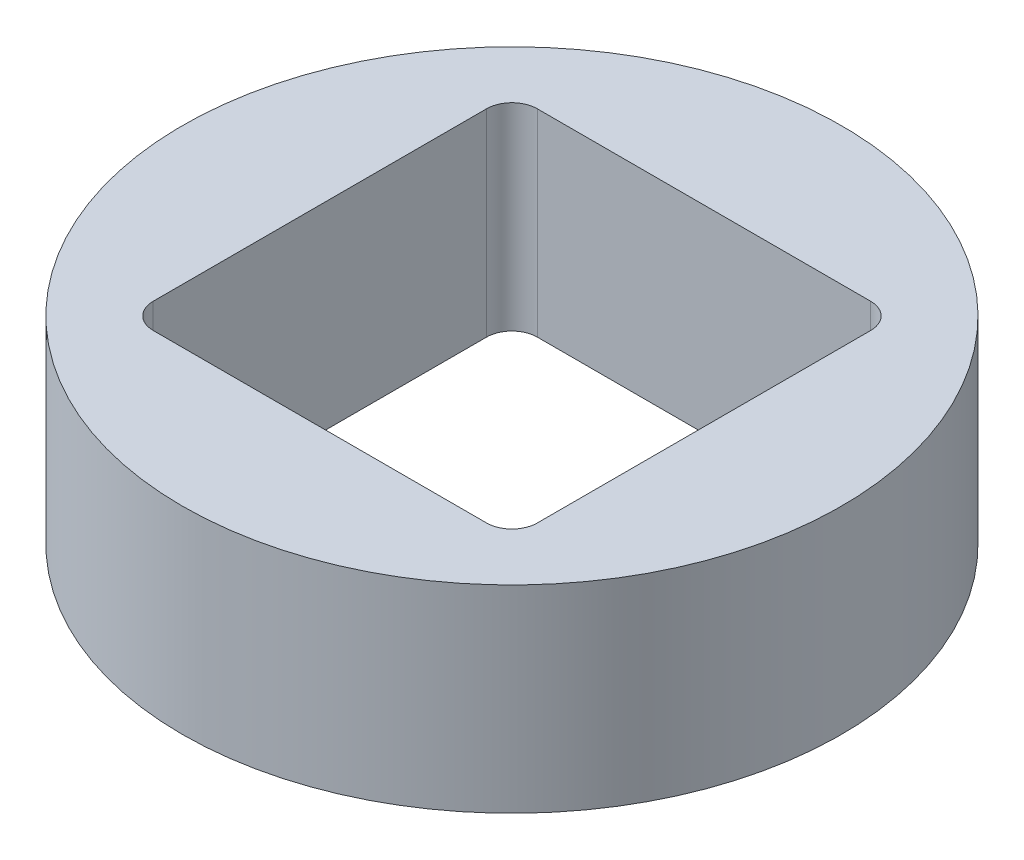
ISO-10303-21;
HEADER;
FILE_DESCRIPTION(('STEP AP214'),'2;1');
FILE_NAME('part.step','',(''),(''),'','','');
FILE_SCHEMA(('AUTOMOTIVE_DESIGN { 1 0 10303 214 1 1 1 1 }'));
ENDSEC;
DATA;
#1=APPLICATION_CONTEXT('core data for automotive mechanical design processes');
#2=APPLICATION_PROTOCOL_DEFINITION('international standard','automotive_design',2000,#1);
#3=PRODUCT_CONTEXT('',#1,'mechanical');
#4=PRODUCT('Part','Part','',(#3));
#5=PRODUCT_RELATED_PRODUCT_CATEGORY('part','',(#4));
#6=PRODUCT_DEFINITION_FORMATION('','',#4);
#7=PRODUCT_DEFINITION_CONTEXT('part definition',#1,'design');
#8=PRODUCT_DEFINITION('design','',#6,#7);
#9=PRODUCT_DEFINITION_SHAPE('','',#8);
#10=(LENGTH_UNIT() NAMED_UNIT(*) SI_UNIT(.MILLI.,.METRE.));
#11=(NAMED_UNIT(*) PLANE_ANGLE_UNIT() SI_UNIT($,.RADIAN.));
#12=(NAMED_UNIT(*) SI_UNIT($,.STERADIAN.) SOLID_ANGLE_UNIT());
#13=UNCERTAINTY_MEASURE_WITH_UNIT(LENGTH_MEASURE(1.E-05),#10,'distance_accuracy_value','');
#14=(GEOMETRIC_REPRESENTATION_CONTEXT(3) GLOBAL_UNCERTAINTY_ASSIGNED_CONTEXT((#13)) GLOBAL_UNIT_ASSIGNED_CONTEXT((#10,
#11,#12)) REPRESENTATION_CONTEXT('',''));
#15=CARTESIAN_POINT('',(0.,0.,0.));
#16=DIRECTION('',(0.,0.,1.));
#17=DIRECTION('',(1.,0.,0.));
#18=AXIS2_PLACEMENT_3D('',#15,#16,#17);
#19=CARTESIAN_POINT('',(0.,15.6,0.));
#20=DIRECTION('',(0.,1.,0.));
#21=DIRECTION('',(0.,0.,1.));
#22=AXIS2_PLACEMENT_3D('',#19,#20,#21);
#23=PLANE('',#22);
#24=CARTESIAN_POINT('',(0.,15.6,0.));
#25=DIRECTION('',(0.,1.,0.));
#26=DIRECTION('',(0.,0.,1.));
#27=AXIS2_PLACEMENT_3D('',#24,#25,#26);
#28=CIRCLE('',#27,26.);
#29=CARTESIAN_POINT('',(0.,15.6,26.));
#30=VERTEX_POINT('',#29);
#31=EDGE_CURVE('E11',#30,#30,#28,.T.);
#32=ORIENTED_EDGE('',*,*,#31,.T.);
#33=EDGE_LOOP('',(#32));
#34=FACE_BOUND('',#33,.T.);
#35=DIRECTION('',(0.,0.,-1.));
#36=VECTOR('',#35,1.);
#37=CARTESIAN_POINT('',(15.15,15.6,13.15));
#38=LINE('',#37,#36);
#39=CARTESIAN_POINT('',(15.15,15.6,13.15));
#40=VERTEX_POINT('',#39);
#41=CARTESIAN_POINT('',(15.15,15.6,-13.15));
#42=VERTEX_POINT('',#41);
#43=EDGE_CURVE('E113',#40,#42,#38,.T.);
#44=ORIENTED_EDGE('',*,*,#43,.F.);
#45=CARTESIAN_POINT('',(13.15,15.6,13.15));
#46=DIRECTION('',(0.,1.,0.));
#47=DIRECTION('',(0.,0.,1.));
#48=AXIS2_PLACEMENT_3D('',#45,#46,#47);
#49=CIRCLE('',#48,2.);
#50=CARTESIAN_POINT('',(13.15,15.6,15.15));
#51=VERTEX_POINT('',#50);
#52=EDGE_CURVE('E104',#51,#40,#49,.T.);
#53=ORIENTED_EDGE('',*,*,#52,.F.);
#54=DIRECTION('',(1.,0.,0.));
#55=VECTOR('',#54,1.);
#56=CARTESIAN_POINT('',(13.15,15.6,15.15));
#57=LINE('',#56,#55);
#58=CARTESIAN_POINT('',(-13.15,15.6,15.15));
#59=VERTEX_POINT('',#58);
#60=EDGE_CURVE('E146',#59,#51,#57,.T.);
#61=ORIENTED_EDGE('',*,*,#60,.F.);
#62=CARTESIAN_POINT('',(-13.15,15.6,13.15));
#63=DIRECTION('',(0.,1.,0.));
#64=DIRECTION('',(0.,0.,-1.));
#65=AXIS2_PLACEMENT_3D('',#62,#63,#64);
#66=CIRCLE('',#65,2.);
#67=CARTESIAN_POINT('',(-15.15,15.6,13.15));
#68=VERTEX_POINT('',#67);
#69=EDGE_CURVE('E143',#68,#59,#66,.T.);
#70=ORIENTED_EDGE('',*,*,#69,.F.);
#71=DIRECTION('',(0.,0.,1.));
#72=VECTOR('',#71,1.);
#73=CARTESIAN_POINT('',(-15.15,15.6,13.15));
#74=LINE('',#73,#72);
#75=CARTESIAN_POINT('',(-15.15,15.6,-13.15));
#76=VERTEX_POINT('',#75);
#77=EDGE_CURVE('E140',#76,#68,#74,.T.);
#78=ORIENTED_EDGE('',*,*,#77,.F.);
#79=CARTESIAN_POINT('',(-13.15,15.6,-13.15));
#80=DIRECTION('',(0.,1.,0.));
#81=DIRECTION('',(0.,0.,1.));
#82=AXIS2_PLACEMENT_3D('',#79,#80,#81);
#83=CIRCLE('',#82,2.);
#84=CARTESIAN_POINT('',(-13.15,15.6,-15.15));
#85=VERTEX_POINT('',#84);
#86=EDGE_CURVE('E137',#85,#76,#83,.T.);
#87=ORIENTED_EDGE('',*,*,#86,.F.);
#88=DIRECTION('',(-1.,0.,0.));
#89=VECTOR('',#88,1.);
#90=CARTESIAN_POINT('',(13.15,15.6,-15.15));
#91=LINE('',#90,#89);
#92=CARTESIAN_POINT('',(13.15,15.6,-15.15));
#93=VERTEX_POINT('',#92);
#94=EDGE_CURVE('E132',#93,#85,#91,.T.);
#95=ORIENTED_EDGE('',*,*,#94,.F.);
#96=CARTESIAN_POINT('',(13.15,15.6,-13.15));
#97=DIRECTION('',(0.,1.,0.));
#98=DIRECTION('',(0.,0.,1.));
#99=AXIS2_PLACEMENT_3D('',#96,#97,#98);
#100=CIRCLE('',#99,2.);
#101=EDGE_CURVE('E126',#42,#93,#100,.T.);
#102=ORIENTED_EDGE('',*,*,#101,.F.);
#103=EDGE_LOOP('',(#44,#53,#61,#70,#78,#87,#95,#102));
#104=FACE_BOUND('',#103,.T.);
#105=ADVANCED_FACE('F38',(#34,#104),#23,.T.);
#106=CARTESIAN_POINT('',(0.,0.,0.));
#107=DIRECTION('',(0.,1.,0.));
#108=DIRECTION('',(0.,0.,1.));
#109=AXIS2_PLACEMENT_3D('',#106,#107,#108);
#110=PLANE('',#109);
#111=CARTESIAN_POINT('',(0.,0.,0.));
#112=DIRECTION('',(0.,1.,0.));
#113=DIRECTION('',(0.,0.,1.));
#114=AXIS2_PLACEMENT_3D('',#111,#112,#113);
#115=CIRCLE('',#114,26.);
#116=CARTESIAN_POINT('',(0.,0.,26.));
#117=VERTEX_POINT('',#116);
#118=EDGE_CURVE('E42',#117,#117,#115,.T.);
#119=ORIENTED_EDGE('',*,*,#118,.F.);
#120=EDGE_LOOP('',(#119));
#121=FACE_BOUND('',#120,.T.);
#122=CARTESIAN_POINT('',(13.15,0.,13.15));
#123=DIRECTION('',(0.,1.,0.));
#124=DIRECTION('',(0.,0.,1.));
#125=AXIS2_PLACEMENT_3D('',#122,#123,#124);
#126=CIRCLE('',#125,2.);
#127=CARTESIAN_POINT('',(13.15,0.,15.15));
#128=VERTEX_POINT('',#127);
#129=CARTESIAN_POINT('',(15.15,0.,13.15));
#130=VERTEX_POINT('',#129);
#131=EDGE_CURVE('E62',#128,#130,#126,.T.);
#132=ORIENTED_EDGE('',*,*,#131,.T.);
#133=DIRECTION('',(0.,0.,-1.));
#134=VECTOR('',#133,1.);
#135=CARTESIAN_POINT('',(15.15,0.,13.15));
#136=LINE('',#135,#134);
#137=CARTESIAN_POINT('',(15.15,0.,-13.15));
#138=VERTEX_POINT('',#137);
#139=EDGE_CURVE('E120',#130,#138,#136,.T.);
#140=ORIENTED_EDGE('',*,*,#139,.T.);
#141=CARTESIAN_POINT('',(13.15,0.,-13.15));
#142=DIRECTION('',(0.,1.,0.));
#143=DIRECTION('',(0.,0.,1.));
#144=AXIS2_PLACEMENT_3D('',#141,#142,#143);
#145=CIRCLE('',#144,2.);
#146=CARTESIAN_POINT('',(13.15,0.,-15.15));
#147=VERTEX_POINT('',#146);
#148=EDGE_CURVE('E153',#138,#147,#145,.T.);
#149=ORIENTED_EDGE('',*,*,#148,.T.);
#150=DIRECTION('',(-1.,0.,0.));
#151=VECTOR('',#150,1.);
#152=CARTESIAN_POINT('',(13.15,0.,-15.15));
#153=LINE('',#152,#151);
#154=CARTESIAN_POINT('',(-13.15,0.,-15.15));
#155=VERTEX_POINT('',#154);
#156=EDGE_CURVE('E157',#147,#155,#153,.T.);
#157=ORIENTED_EDGE('',*,*,#156,.T.);
#158=CARTESIAN_POINT('',(-13.15,0.,-13.15));
#159=DIRECTION('',(0.,1.,0.));
#160=DIRECTION('',(0.,0.,1.));
#161=AXIS2_PLACEMENT_3D('',#158,#159,#160);
#162=CIRCLE('',#161,2.);
#163=CARTESIAN_POINT('',(-15.15,0.,-13.15));
#164=VERTEX_POINT('',#163);
#165=EDGE_CURVE('E161',#155,#164,#162,.T.);
#166=ORIENTED_EDGE('',*,*,#165,.T.);
#167=DIRECTION('',(0.,0.,1.));
#168=VECTOR('',#167,1.);
#169=CARTESIAN_POINT('',(-15.15,0.,13.15));
#170=LINE('',#169,#168);
#171=CARTESIAN_POINT('',(-15.15,0.,13.15));
#172=VERTEX_POINT('',#171);
#173=EDGE_CURVE('E164',#164,#172,#170,.T.);
#174=ORIENTED_EDGE('',*,*,#173,.T.);
#175=CARTESIAN_POINT('',(-13.15,0.,13.15));
#176=DIRECTION('',(0.,1.,0.));
#177=DIRECTION('',(0.,0.,-1.));
#178=AXIS2_PLACEMENT_3D('',#175,#176,#177);
#179=CIRCLE('',#178,2.);
#180=CARTESIAN_POINT('',(-13.15,0.,15.15));
#181=VERTEX_POINT('',#180);
#182=EDGE_CURVE('E168',#172,#181,#179,.T.);
#183=ORIENTED_EDGE('',*,*,#182,.T.);
#184=DIRECTION('',(1.,0.,0.));
#185=VECTOR('',#184,1.);
#186=CARTESIAN_POINT('',(13.15,0.,15.15));
#187=LINE('',#186,#185);
#188=EDGE_CURVE('E114',#181,#128,#187,.T.);
#189=ORIENTED_EDGE('',*,*,#188,.T.);
#190=EDGE_LOOP('',(#132,#140,#149,#157,#166,#174,#183,#189));
#191=FACE_BOUND('',#190,.T.);
#192=ADVANCED_FACE('F197',(#121,#191),#110,.F.);
#193=CARTESIAN_POINT('',(0.,15.6,0.));
#194=DIRECTION('',(0.,-1.,0.));
#195=DIRECTION('',(0.,0.,-1.));
#196=AXIS2_PLACEMENT_3D('',#193,#194,#195);
#197=CYLINDRICAL_SURFACE('',#196,26.);
#198=ORIENTED_EDGE('',*,*,#31,.F.);
#199=EDGE_LOOP('',(#198));
#200=FACE_BOUND('',#199,.T.);
#201=ORIENTED_EDGE('',*,*,#118,.T.);
#202=EDGE_LOOP('',(#201));
#203=FACE_BOUND('',#202,.T.);
#204=ADVANCED_FACE('F40',(#200,#203),#197,.T.);
#205=CARTESIAN_POINT('',(13.15,15.6,13.15));
#206=DIRECTION('',(0.,-1.,0.));
#207=DIRECTION('',(0.,0.,-1.));
#208=AXIS2_PLACEMENT_3D('',#205,#206,#207);
#209=CYLINDRICAL_SURFACE('',#208,2.);
#210=ORIENTED_EDGE('',*,*,#131,.F.);
#211=DIRECTION('',(0.,-1.,0.));
#212=VECTOR('',#211,1.);
#213=CARTESIAN_POINT('',(13.15,15.6,15.15));
#214=LINE('',#213,#212);
#215=EDGE_CURVE('E108',#51,#128,#214,.T.);
#216=ORIENTED_EDGE('',*,*,#215,.F.);
#217=ORIENTED_EDGE('',*,*,#52,.T.);
#218=DIRECTION('',(0.,-1.,0.));
#219=VECTOR('',#218,1.);
#220=CARTESIAN_POINT('',(15.15,15.6,13.15));
#221=LINE('',#220,#219);
#222=EDGE_CURVE('E107',#40,#130,#221,.T.);
#223=ORIENTED_EDGE('',*,*,#222,.T.);
#224=EDGE_LOOP('',(#210,#216,#217,#223));
#225=FACE_BOUND('',#224,.T.);
#226=ADVANCED_FACE('F106',(#225),#209,.F.);
#227=CARTESIAN_POINT('',(15.15,15.6,13.15));
#228=DIRECTION('',(-1.,0.,0.));
#229=DIRECTION('',(0.,0.,1.));
#230=AXIS2_PLACEMENT_3D('',#227,#228,#229);
#231=PLANE('',#230);
#232=ORIENTED_EDGE('',*,*,#139,.F.);
#233=ORIENTED_EDGE('',*,*,#222,.F.);
#234=ORIENTED_EDGE('',*,*,#43,.T.);
#235=DIRECTION('',(0.,-1.,0.));
#236=VECTOR('',#235,1.);
#237=CARTESIAN_POINT('',(15.15,15.6,-13.15));
#238=LINE('',#237,#236);
#239=EDGE_CURVE('E122',#42,#138,#238,.T.);
#240=ORIENTED_EDGE('',*,*,#239,.T.);
#241=EDGE_LOOP('',(#232,#233,#234,#240));
#242=FACE_BOUND('',#241,.T.);
#243=ADVANCED_FACE('F117',(#242),#231,.T.);
#244=CARTESIAN_POINT('',(13.15,15.6,-13.15));
#245=DIRECTION('',(0.,-1.,0.));
#246=DIRECTION('',(0.,0.,-1.));
#247=AXIS2_PLACEMENT_3D('',#244,#245,#246);
#248=CYLINDRICAL_SURFACE('',#247,2.);
#249=ORIENTED_EDGE('',*,*,#148,.F.);
#250=ORIENTED_EDGE('',*,*,#239,.F.);
#251=ORIENTED_EDGE('',*,*,#101,.T.);
#252=DIRECTION('',(0.,-1.,0.));
#253=VECTOR('',#252,1.);
#254=CARTESIAN_POINT('',(13.15,15.6,-15.15));
#255=LINE('',#254,#253);
#256=EDGE_CURVE('E187',#93,#147,#255,.T.);
#257=ORIENTED_EDGE('',*,*,#256,.T.);
#258=EDGE_LOOP('',(#249,#250,#251,#257));
#259=FACE_BOUND('',#258,.T.);
#260=ADVANCED_FACE('F193',(#259),#248,.F.);
#261=CARTESIAN_POINT('',(13.15,15.6,-15.15));
#262=DIRECTION('',(0.,0.,1.));
#263=DIRECTION('',(1.,0.,0.));
#264=AXIS2_PLACEMENT_3D('',#261,#262,#263);
#265=PLANE('',#264);
#266=ORIENTED_EDGE('',*,*,#156,.F.);
#267=ORIENTED_EDGE('',*,*,#256,.F.);
#268=ORIENTED_EDGE('',*,*,#94,.T.);
#269=DIRECTION('',(0.,-1.,0.));
#270=VECTOR('',#269,1.);
#271=CARTESIAN_POINT('',(-13.15,15.6,-15.15));
#272=LINE('',#271,#270);
#273=EDGE_CURVE('E184',#85,#155,#272,.T.);
#274=ORIENTED_EDGE('',*,*,#273,.T.);
#275=EDGE_LOOP('',(#266,#267,#268,#274));
#276=FACE_BOUND('',#275,.T.);
#277=ADVANCED_FACE('F215',(#276),#265,.T.);
#278=CARTESIAN_POINT('',(-13.15,15.6,-13.15));
#279=DIRECTION('',(0.,-1.,0.));
#280=DIRECTION('',(0.,0.,-1.));
#281=AXIS2_PLACEMENT_3D('',#278,#279,#280);
#282=CYLINDRICAL_SURFACE('',#281,2.);
#283=ORIENTED_EDGE('',*,*,#165,.F.);
#284=ORIENTED_EDGE('',*,*,#273,.F.);
#285=ORIENTED_EDGE('',*,*,#86,.T.);
#286=DIRECTION('',(0.,-1.,0.));
#287=VECTOR('',#286,1.);
#288=CARTESIAN_POINT('',(-15.15,15.6,-13.15));
#289=LINE('',#288,#287);
#290=EDGE_CURVE('E181',#76,#164,#289,.T.);
#291=ORIENTED_EDGE('',*,*,#290,.T.);
#292=EDGE_LOOP('',(#283,#284,#285,#291));
#293=FACE_BOUND('',#292,.T.);
#294=ADVANCED_FACE('F212',(#293),#282,.F.);
#295=CARTESIAN_POINT('',(-15.15,15.6,13.15));
#296=DIRECTION('',(1.,0.,0.));
#297=DIRECTION('',(0.,0.,-1.));
#298=AXIS2_PLACEMENT_3D('',#295,#296,#297);
#299=PLANE('',#298);
#300=ORIENTED_EDGE('',*,*,#173,.F.);
#301=ORIENTED_EDGE('',*,*,#290,.F.);
#302=ORIENTED_EDGE('',*,*,#77,.T.);
#303=DIRECTION('',(0.,-1.,0.));
#304=VECTOR('',#303,1.);
#305=CARTESIAN_POINT('',(-15.15,15.6,13.15));
#306=LINE('',#305,#304);
#307=EDGE_CURVE('E178',#68,#172,#306,.T.);
#308=ORIENTED_EDGE('',*,*,#307,.T.);
#309=EDGE_LOOP('',(#300,#301,#302,#308));
#310=FACE_BOUND('',#309,.T.);
#311=ADVANCED_FACE('F208',(#310),#299,.T.);
#312=CARTESIAN_POINT('',(-13.15,15.6,13.15));
#313=DIRECTION('',(0.,-1.,0.));
#314=DIRECTION('',(0.,0.,-1.));
#315=AXIS2_PLACEMENT_3D('',#312,#313,#314);
#316=CYLINDRICAL_SURFACE('',#315,2.);
#317=ORIENTED_EDGE('',*,*,#182,.F.);
#318=ORIENTED_EDGE('',*,*,#307,.F.);
#319=ORIENTED_EDGE('',*,*,#69,.T.);
#320=DIRECTION('',(0.,-1.,0.));
#321=VECTOR('',#320,1.);
#322=CARTESIAN_POINT('',(-13.15,15.6,15.15));
#323=LINE('',#322,#321);
#324=EDGE_CURVE('E54',#59,#181,#323,.T.);
#325=ORIENTED_EDGE('',*,*,#324,.T.);
#326=EDGE_LOOP('',(#317,#318,#319,#325));
#327=FACE_BOUND('',#326,.T.);
#328=ADVANCED_FACE('F205',(#327),#316,.F.);
#329=CARTESIAN_POINT('',(13.15,15.6,15.15));
#330=DIRECTION('',(0.,0.,-1.));
#331=DIRECTION('',(-1.,0.,0.));
#332=AXIS2_PLACEMENT_3D('',#329,#330,#331);
#333=PLANE('',#332);
#334=ORIENTED_EDGE('',*,*,#188,.F.);
#335=ORIENTED_EDGE('',*,*,#324,.F.);
#336=ORIENTED_EDGE('',*,*,#60,.T.);
#337=ORIENTED_EDGE('',*,*,#215,.T.);
#338=EDGE_LOOP('',(#334,#335,#336,#337));
#339=FACE_BOUND('',#338,.T.);
#340=ADVANCED_FACE('F199',(#339),#333,.T.);
#341=CLOSED_SHELL('',(#105,#192,#204,#226,#243,#260,#277,#294,#311,#328,#340));
#342=MANIFOLD_SOLID_BREP('B2',#341);
#343=ADVANCED_BREP_SHAPE_REPRESENTATION('',(#18,#342),#14);
#344=SHAPE_DEFINITION_REPRESENTATION(#9,#343);
ENDSEC;
END-ISO-10303-21;
